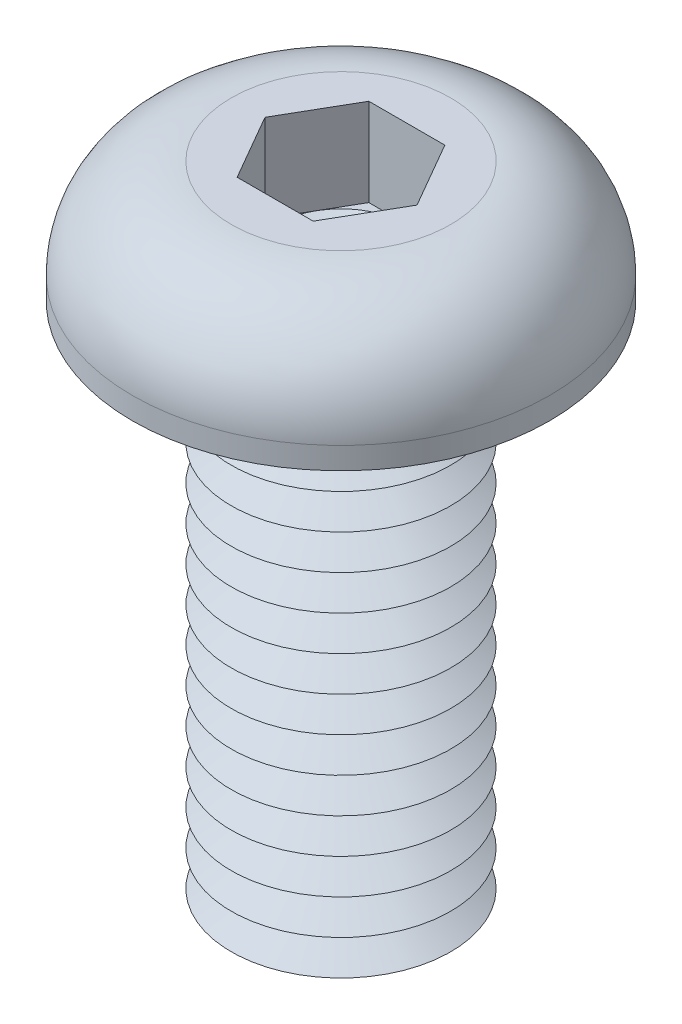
ISO-10303-21;
HEADER;
FILE_DESCRIPTION(('STEP AP214'),'2;1');
FILE_NAME('part.step','',(''),(''),'','','');
FILE_SCHEMA(('AUTOMOTIVE_DESIGN { 1 0 10303 214 1 1 1 1 }'));
ENDSEC;
DATA;
#1=APPLICATION_CONTEXT('core data for automotive mechanical design processes');
#2=APPLICATION_PROTOCOL_DEFINITION('international standard','automotive_design',2000,#1);
#3=PRODUCT_CONTEXT('',#1,'mechanical');
#4=PRODUCT('Part','Part','',(#3));
#5=PRODUCT_RELATED_PRODUCT_CATEGORY('part','',(#4));
#6=PRODUCT_DEFINITION_FORMATION('','',#4);
#7=PRODUCT_DEFINITION_CONTEXT('part definition',#1,'design');
#8=PRODUCT_DEFINITION('design','',#6,#7);
#9=PRODUCT_DEFINITION_SHAPE('','',#8);
#10=(LENGTH_UNIT() NAMED_UNIT(*) SI_UNIT(.MILLI.,.METRE.));
#11=(NAMED_UNIT(*) PLANE_ANGLE_UNIT() SI_UNIT($,.RADIAN.));
#12=(NAMED_UNIT(*) SI_UNIT($,.STERADIAN.) SOLID_ANGLE_UNIT());
#13=UNCERTAINTY_MEASURE_WITH_UNIT(LENGTH_MEASURE(1.E-05),#10,'distance_accuracy_value','');
#14=(GEOMETRIC_REPRESENTATION_CONTEXT(3) GLOBAL_UNCERTAINTY_ASSIGNED_CONTEXT((#13)) GLOBAL_UNIT_ASSIGNED_CONTEXT((#10,
#11,#12)) REPRESENTATION_CONTEXT('',''));
#15=CARTESIAN_POINT('',(0.,0.,0.));
#16=DIRECTION('',(0.,0.,1.));
#17=DIRECTION('',(1.,0.,0.));
#18=AXIS2_PLACEMENT_3D('',#15,#16,#17);
#19=CARTESIAN_POINT('',(0.,0.,0.));
#20=DIRECTION('',(0.,-1.,0.));
#21=DIRECTION('',(0.,0.,-1.));
#22=AXIS2_PLACEMENT_3D('',#19,#20,#21);
#23=TOROIDAL_SURFACE('',#22,2.9,0.4);
#24=CARTESIAN_POINT('',(0.,0.,-3.3));
#25=VERTEX_POINT('',#24);
#26=VERTEX_LOOP('',#25);
#27=FACE_BOUND('',#26,.T.);
#28=ADVANCED_FACE('P0_F12',(#27),#23,.T.);
#29=CLOSED_SHELL('',(#28));
#30=MANIFOLD_SOLID_BREP('P0_B1',#29);
#31=CARTESIAN_POINT('',(0.866025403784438,0.75,-1.5));
#32=DIRECTION('',(0.,1.,0.));
#33=DIRECTION('',(0.,0.,1.));
#34=AXIS2_PLACEMENT_3D('',#31,#32,#33);
#35=PLANE('',#34);
#36=CARTESIAN_POINT('',(0.,0.75,0.));
#37=DIRECTION('',(0.,1.,0.));
#38=DIRECTION('',(0.,0.,1.));
#39=AXIS2_PLACEMENT_3D('',#36,#37,#38);
#40=CIRCLE('',#39,1.5);
#41=CARTESIAN_POINT('',(0.,0.75,1.5));
#42=VERTEX_POINT('',#41);
#43=CARTESIAN_POINT('',(1.29903810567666,0.75,0.75));
#44=VERTEX_POINT('',#43);
#45=EDGE_CURVE('P1_E26',#42,#44,#40,.T.);
#46=ORIENTED_EDGE('',*,*,#45,.F.);
#47=DIRECTION('',(1.,0.,0.));
#48=VECTOR('',#47,1.);
#49=CARTESIAN_POINT('',(-0.866025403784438,0.75,1.5));
#50=LINE('',#49,#48);
#51=CARTESIAN_POINT('',(0.866025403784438,0.75,1.5));
#52=VERTEX_POINT('',#51);
#53=EDGE_CURVE('P1_E117',#42,#52,#50,.T.);
#54=ORIENTED_EDGE('',*,*,#53,.T.);
#55=DIRECTION('',(0.5,0.,-0.866025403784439));
#56=VECTOR('',#55,1.);
#57=CARTESIAN_POINT('',(0.866025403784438,0.75,1.5));
#58=LINE('',#57,#56);
#59=EDGE_CURVE('P1_E113',#52,#44,#58,.T.);
#60=ORIENTED_EDGE('',*,*,#59,.T.);
#61=EDGE_LOOP('',(#46,#54,#60));
#62=FACE_BOUND('',#61,.T.);
#63=ADVANCED_FACE('P1_F15',(#62),#35,.T.);
#64=CARTESIAN_POINT('',(1.29903810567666,0.75,-0.750000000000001));
#65=VERTEX_POINT('',#64);
#66=EDGE_CURVE('P1_E10',#44,#65,#40,.T.);
#67=ORIENTED_EDGE('',*,*,#66,.F.);
#68=CARTESIAN_POINT('',(1.73205080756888,0.75,0.));
#69=VERTEX_POINT('',#68);
#70=EDGE_CURVE('P1_E105',#44,#69,#58,.T.);
#71=ORIENTED_EDGE('',*,*,#70,.T.);
#72=DIRECTION('',(-0.5,0.,-0.866025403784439));
#73=VECTOR('',#72,1.);
#74=CARTESIAN_POINT('',(1.73205080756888,0.75,0.));
#75=LINE('',#74,#73);
#76=EDGE_CURVE('P1_E108',#69,#65,#75,.T.);
#77=ORIENTED_EDGE('',*,*,#76,.T.);
#78=EDGE_LOOP('',(#67,#71,#77));
#79=FACE_BOUND('',#78,.T.);
#80=ADVANCED_FACE('P1_F104',(#79),#35,.T.);
#81=CARTESIAN_POINT('',(0.,0.75,-1.5));
#82=VERTEX_POINT('',#81);
#83=EDGE_CURVE('P1_E24',#65,#82,#40,.T.);
#84=ORIENTED_EDGE('',*,*,#83,.F.);
#85=CARTESIAN_POINT('',(0.866025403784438,0.75,-1.5));
#86=VERTEX_POINT('',#85);
#87=EDGE_CURVE('P1_E140',#65,#86,#75,.T.);
#88=ORIENTED_EDGE('',*,*,#87,.T.);
#89=DIRECTION('',(-1.,0.,0.));
#90=VECTOR('',#89,1.);
#91=CARTESIAN_POINT('',(0.866025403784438,0.75,-1.5));
#92=LINE('',#91,#90);
#93=EDGE_CURVE('P1_E249',#86,#82,#92,.T.);
#94=ORIENTED_EDGE('',*,*,#93,.T.);
#95=EDGE_LOOP('',(#84,#88,#94));
#96=FACE_BOUND('',#95,.T.);
#97=ADVANCED_FACE('P1_F286',(#96),#35,.T.);
#98=CARTESIAN_POINT('',(-1.29903810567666,0.75,-0.75));
#99=VERTEX_POINT('',#98);
#100=EDGE_CURVE('P1_E245',#82,#99,#40,.T.);
#101=ORIENTED_EDGE('',*,*,#100,.F.);
#102=CARTESIAN_POINT('',(-0.866025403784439,0.75,-1.5));
#103=VERTEX_POINT('',#102);
#104=EDGE_CURVE('P1_E248',#82,#103,#92,.T.);
#105=ORIENTED_EDGE('',*,*,#104,.T.);
#106=DIRECTION('',(-0.5,0.,0.866025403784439));
#107=VECTOR('',#106,1.);
#108=CARTESIAN_POINT('',(-0.866025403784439,0.75,-1.5));
#109=LINE('',#108,#107);
#110=EDGE_CURVE('P1_E253',#103,#99,#109,.T.);
#111=ORIENTED_EDGE('',*,*,#110,.T.);
#112=EDGE_LOOP('',(#101,#105,#111));
#113=FACE_BOUND('',#112,.T.);
#114=ADVANCED_FACE('P1_F294',(#113),#35,.T.);
#115=CARTESIAN_POINT('',(-1.29903810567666,0.75,0.75));
#116=VERTEX_POINT('',#115);
#117=EDGE_CURVE('P1_E33',#99,#116,#40,.T.);
#118=ORIENTED_EDGE('',*,*,#117,.F.);
#119=CARTESIAN_POINT('',(-1.73205080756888,0.75,0.));
#120=VERTEX_POINT('',#119);
#121=EDGE_CURVE('P1_E252',#99,#120,#109,.T.);
#122=ORIENTED_EDGE('',*,*,#121,.T.);
#123=DIRECTION('',(0.5,0.,0.866025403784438));
#124=VECTOR('',#123,1.);
#125=CARTESIAN_POINT('',(-1.73205080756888,0.75,0.));
#126=LINE('',#125,#124);
#127=EDGE_CURVE('P1_E256',#120,#116,#126,.T.);
#128=ORIENTED_EDGE('',*,*,#127,.T.);
#129=EDGE_LOOP('',(#118,#122,#128));
#130=FACE_BOUND('',#129,.T.);
#131=ADVANCED_FACE('P1_F290',(#130),#35,.T.);
#132=CARTESIAN_POINT('',(0.,-11.2,0.));
#133=DIRECTION('',(0.,1.,0.));
#134=DIRECTION('',(0.,0.,1.));
#135=AXIS2_PLACEMENT_3D('',#132,#133,#134);
#136=CONICAL_SURFACE('',#135,1.80717967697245,1.0471975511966);
#137=CARTESIAN_POINT('',(0.,-10.8,0.));
#138=DIRECTION('',(0.,-1.,0.));
#139=DIRECTION('',(0.,0.,-1.));
#140=AXIS2_PLACEMENT_3D('',#137,#138,#139);
#141=CIRCLE('',#140,2.5);
#142=CARTESIAN_POINT('',(0.,-10.8,-2.5));
#143=VERTEX_POINT('',#142);
#144=EDGE_CURVE('P1_E233',#143,#143,#141,.T.);
#145=ORIENTED_EDGE('',*,*,#144,.T.);
#146=EDGE_LOOP('',(#145));
#147=FACE_BOUND('',#146,.T.);
#148=CARTESIAN_POINT('',(0.,-11.2,0.));
#149=DIRECTION('',(0.,-1.,0.));
#150=DIRECTION('',(0.,0.,-1.));
#151=AXIS2_PLACEMENT_3D('',#148,#149,#150);
#152=CIRCLE('',#151,1.80717967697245);
#153=CARTESIAN_POINT('',(0.,-11.2,-1.80717967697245));
#154=VERTEX_POINT('',#153);
#155=EDGE_CURVE('P1_E236',#154,#154,#152,.T.);
#156=ORIENTED_EDGE('',*,*,#155,.F.);
#157=EDGE_LOOP('',(#156));
#158=FACE_BOUND('',#157,.T.);
#159=ADVANCED_FACE('P1_F302',(#147,#158),#136,.T.);
#160=CARTESIAN_POINT('',(0.,-11.6,0.));
#161=DIRECTION('',(0.,-1.,0.));
#162=DIRECTION('',(0.,0.,-1.));
#163=AXIS2_PLACEMENT_3D('',#160,#161,#162);
#164=CONICAL_SURFACE('',#163,2.5,1.0471975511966);
#165=ORIENTED_EDGE('',*,*,#155,.T.);
#166=EDGE_LOOP('',(#165));
#167=FACE_BOUND('',#166,.T.);
#168=CARTESIAN_POINT('',(0.,-11.6,0.));
#169=DIRECTION('',(0.,-1.,0.));
#170=DIRECTION('',(0.,0.,-1.));
#171=AXIS2_PLACEMENT_3D('',#168,#169,#170);
#172=CIRCLE('',#171,2.5);
#173=CARTESIAN_POINT('',(0.,-11.6,-2.5));
#174=VERTEX_POINT('',#173);
#175=EDGE_CURVE('P1_E239',#174,#174,#172,.T.);
#176=ORIENTED_EDGE('',*,*,#175,.F.);
#177=EDGE_LOOP('',(#176));
#178=FACE_BOUND('',#177,.T.);
#179=ADVANCED_FACE('P1_F436',(#167,#178),#164,.T.);
#180=CARTESIAN_POINT('',(0.,-12.,0.));
#181=DIRECTION('',(0.,1.,0.));
#182=DIRECTION('',(0.,0.,1.));
#183=AXIS2_PLACEMENT_3D('',#180,#181,#182);
#184=PLANE('',#183);
#185=CARTESIAN_POINT('',(0.,-12.,0.));
#186=DIRECTION('',(0.,-1.,0.));
#187=DIRECTION('',(0.,0.,-1.));
#188=AXIS2_PLACEMENT_3D('',#185,#186,#187);
#189=CIRCLE('',#188,1.80717967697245);
#190=CARTESIAN_POINT('',(0.,-12.,-1.80717967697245));
#191=VERTEX_POINT('',#190);
#192=EDGE_CURVE('P1_E241',#191,#191,#189,.T.);
#193=ORIENTED_EDGE('',*,*,#192,.T.);
#194=EDGE_LOOP('',(#193));
#195=FACE_BOUND('',#194,.T.);
#196=ADVANCED_FACE('P1_F439',(#195),#184,.F.);
#197=CARTESIAN_POINT('',(0.,-12.,0.));
#198=DIRECTION('',(0.,1.,0.));
#199=DIRECTION('',(0.,0.,1.));
#200=AXIS2_PLACEMENT_3D('',#197,#198,#199);
#201=CONICAL_SURFACE('',#200,1.80717967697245,1.0471975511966);
#202=ORIENTED_EDGE('',*,*,#175,.T.);
#203=EDGE_LOOP('',(#202));
#204=FACE_BOUND('',#203,.T.);
#205=ORIENTED_EDGE('',*,*,#192,.F.);
#206=EDGE_LOOP('',(#205));
#207=FACE_BOUND('',#206,.T.);
#208=ADVANCED_FACE('P1_F434',(#204,#207),#201,.T.);
#209=CARTESIAN_POINT('',(0.,-10.4,0.));
#210=DIRECTION('',(0.,1.,0.));
#211=DIRECTION('',(0.,0.,1.));
#212=AXIS2_PLACEMENT_3D('',#209,#210,#211);
#213=CONICAL_SURFACE('',#212,1.80717967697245,1.0471975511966);
#214=CARTESIAN_POINT('',(0.,-10.,0.));
#215=DIRECTION('',(0.,-1.,0.));
#216=DIRECTION('',(0.,0.,-1.));
#217=AXIS2_PLACEMENT_3D('',#214,#215,#216);
#218=CIRCLE('',#217,2.5);
#219=CARTESIAN_POINT('',(0.,-10.,-2.5));
#220=VERTEX_POINT('',#219);
#221=EDGE_CURVE('P1_E227',#220,#220,#218,.T.);
#222=ORIENTED_EDGE('',*,*,#221,.T.);
#223=EDGE_LOOP('',(#222));
#224=FACE_BOUND('',#223,.T.);
#225=CARTESIAN_POINT('',(0.,-10.4,0.));
#226=DIRECTION('',(0.,-1.,0.));
#227=DIRECTION('',(0.,0.,-1.));
#228=AXIS2_PLACEMENT_3D('',#225,#226,#227);
#229=CIRCLE('',#228,1.80717967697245);
#230=CARTESIAN_POINT('',(0.,-10.4,-1.80717967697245));
#231=VERTEX_POINT('',#230);
#232=EDGE_CURVE('P1_E230',#231,#231,#229,.T.);
#233=ORIENTED_EDGE('',*,*,#232,.F.);
#234=EDGE_LOOP('',(#233));
#235=FACE_BOUND('',#234,.T.);
#236=ADVANCED_FACE('P1_F430',(#224,#235),#213,.T.);
#237=CARTESIAN_POINT('',(0.,-10.8,0.));
#238=DIRECTION('',(0.,-1.,0.));
#239=DIRECTION('',(0.,0.,-1.));
#240=AXIS2_PLACEMENT_3D('',#237,#238,#239);
#241=CONICAL_SURFACE('',#240,2.5,1.0471975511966);
#242=ORIENTED_EDGE('',*,*,#232,.T.);
#243=EDGE_LOOP('',(#242));
#244=FACE_BOUND('',#243,.T.);
#245=ORIENTED_EDGE('',*,*,#144,.F.);
#246=EDGE_LOOP('',(#245));
#247=FACE_BOUND('',#246,.T.);
#248=ADVANCED_FACE('P1_F426',(#244,#247),#241,.T.);
#249=CARTESIAN_POINT('',(0.,-9.6,0.));
#250=DIRECTION('',(0.,1.,0.));
#251=DIRECTION('',(0.,0.,1.));
#252=AXIS2_PLACEMENT_3D('',#249,#250,#251);
#253=CONICAL_SURFACE('',#252,1.80717967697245,1.0471975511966);
#254=CARTESIAN_POINT('',(0.,-9.2,0.));
#255=DIRECTION('',(0.,-1.,0.));
#256=DIRECTION('',(0.,0.,-1.));
#257=AXIS2_PLACEMENT_3D('',#254,#255,#256);
#258=CIRCLE('',#257,2.5);
#259=CARTESIAN_POINT('',(0.,-9.2,-2.5));
#260=VERTEX_POINT('',#259);
#261=EDGE_CURVE('P1_E221',#260,#260,#258,.T.);
#262=ORIENTED_EDGE('',*,*,#261,.T.);
#263=EDGE_LOOP('',(#262));
#264=FACE_BOUND('',#263,.T.);
#265=CARTESIAN_POINT('',(0.,-9.6,0.));
#266=DIRECTION('',(0.,-1.,0.));
#267=DIRECTION('',(0.,0.,-1.));
#268=AXIS2_PLACEMENT_3D('',#265,#266,#267);
#269=CIRCLE('',#268,1.80717967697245);
#270=CARTESIAN_POINT('',(0.,-9.6,-1.80717967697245));
#271=VERTEX_POINT('',#270);
#272=EDGE_CURVE('P1_E224',#271,#271,#269,.T.);
#273=ORIENTED_EDGE('',*,*,#272,.F.);
#274=EDGE_LOOP('',(#273));
#275=FACE_BOUND('',#274,.T.);
#276=ADVANCED_FACE('P1_F422',(#264,#275),#253,.T.);
#277=CARTESIAN_POINT('',(0.,-10.,0.));
#278=DIRECTION('',(0.,-1.,0.));
#279=DIRECTION('',(0.,0.,-1.));
#280=AXIS2_PLACEMENT_3D('',#277,#278,#279);
#281=CONICAL_SURFACE('',#280,2.5,1.0471975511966);
#282=ORIENTED_EDGE('',*,*,#272,.T.);
#283=EDGE_LOOP('',(#282));
#284=FACE_BOUND('',#283,.T.);
#285=ORIENTED_EDGE('',*,*,#221,.F.);
#286=EDGE_LOOP('',(#285));
#287=FACE_BOUND('',#286,.T.);
#288=ADVANCED_FACE('P1_F418',(#284,#287),#281,.T.);
#289=CARTESIAN_POINT('',(0.,-8.8,0.));
#290=DIRECTION('',(0.,1.,0.));
#291=DIRECTION('',(0.,0.,1.));
#292=AXIS2_PLACEMENT_3D('',#289,#290,#291);
#293=CONICAL_SURFACE('',#292,1.80717967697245,1.0471975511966);
#294=CARTESIAN_POINT('',(0.,-8.4,0.));
#295=DIRECTION('',(0.,-1.,0.));
#296=DIRECTION('',(0.,0.,-1.));
#297=AXIS2_PLACEMENT_3D('',#294,#295,#296);
#298=CIRCLE('',#297,2.5);
#299=CARTESIAN_POINT('',(0.,-8.4,-2.5));
#300=VERTEX_POINT('',#299);
#301=EDGE_CURVE('P1_E215',#300,#300,#298,.T.);
#302=ORIENTED_EDGE('',*,*,#301,.T.);
#303=EDGE_LOOP('',(#302));
#304=FACE_BOUND('',#303,.T.);
#305=CARTESIAN_POINT('',(0.,-8.8,0.));
#306=DIRECTION('',(0.,-1.,0.));
#307=DIRECTION('',(0.,0.,-1.));
#308=AXIS2_PLACEMENT_3D('',#305,#306,#307);
#309=CIRCLE('',#308,1.80717967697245);
#310=CARTESIAN_POINT('',(0.,-8.8,-1.80717967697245));
#311=VERTEX_POINT('',#310);
#312=EDGE_CURVE('P1_E218',#311,#311,#309,.T.);
#313=ORIENTED_EDGE('',*,*,#312,.F.);
#314=EDGE_LOOP('',(#313));
#315=FACE_BOUND('',#314,.T.);
#316=ADVANCED_FACE('P1_F414',(#304,#315),#293,.T.);
#317=CARTESIAN_POINT('',(0.,-9.2,0.));
#318=DIRECTION('',(0.,-1.,0.));
#319=DIRECTION('',(0.,0.,-1.));
#320=AXIS2_PLACEMENT_3D('',#317,#318,#319);
#321=CONICAL_SURFACE('',#320,2.5,1.0471975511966);
#322=ORIENTED_EDGE('',*,*,#312,.T.);
#323=EDGE_LOOP('',(#322));
#324=FACE_BOUND('',#323,.T.);
#325=ORIENTED_EDGE('',*,*,#261,.F.);
#326=EDGE_LOOP('',(#325));
#327=FACE_BOUND('',#326,.T.);
#328=ADVANCED_FACE('P1_F410',(#324,#327),#321,.T.);
#329=CARTESIAN_POINT('',(0.,-8.,0.));
#330=DIRECTION('',(0.,1.,0.));
#331=DIRECTION('',(0.,0.,1.));
#332=AXIS2_PLACEMENT_3D('',#329,#330,#331);
#333=CONICAL_SURFACE('',#332,1.80717967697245,1.0471975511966);
#334=CARTESIAN_POINT('',(0.,-7.6,0.));
#335=DIRECTION('',(0.,-1.,0.));
#336=DIRECTION('',(0.,0.,-1.));
#337=AXIS2_PLACEMENT_3D('',#334,#335,#336);
#338=CIRCLE('',#337,2.5);
#339=CARTESIAN_POINT('',(0.,-7.6,-2.5));
#340=VERTEX_POINT('',#339);
#341=EDGE_CURVE('P1_E209',#340,#340,#338,.T.);
#342=ORIENTED_EDGE('',*,*,#341,.T.);
#343=EDGE_LOOP('',(#342));
#344=FACE_BOUND('',#343,.T.);
#345=CARTESIAN_POINT('',(0.,-8.,0.));
#346=DIRECTION('',(0.,-1.,0.));
#347=DIRECTION('',(0.,0.,-1.));
#348=AXIS2_PLACEMENT_3D('',#345,#346,#347);
#349=CIRCLE('',#348,1.80717967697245);
#350=CARTESIAN_POINT('',(0.,-8.,-1.80717967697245));
#351=VERTEX_POINT('',#350);
#352=EDGE_CURVE('P1_E212',#351,#351,#349,.T.);
#353=ORIENTED_EDGE('',*,*,#352,.F.);
#354=EDGE_LOOP('',(#353));
#355=FACE_BOUND('',#354,.T.);
#356=ADVANCED_FACE('P1_F406',(#344,#355),#333,.T.);
#357=CARTESIAN_POINT('',(0.,-8.4,0.));
#358=DIRECTION('',(0.,-1.,0.));
#359=DIRECTION('',(0.,0.,-1.));
#360=AXIS2_PLACEMENT_3D('',#357,#358,#359);
#361=CONICAL_SURFACE('',#360,2.5,1.0471975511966);
#362=ORIENTED_EDGE('',*,*,#352,.T.);
#363=EDGE_LOOP('',(#362));
#364=FACE_BOUND('',#363,.T.);
#365=ORIENTED_EDGE('',*,*,#301,.F.);
#366=EDGE_LOOP('',(#365));
#367=FACE_BOUND('',#366,.T.);
#368=ADVANCED_FACE('P1_F402',(#364,#367),#361,.T.);
#369=CARTESIAN_POINT('',(0.,-7.2,0.));
#370=DIRECTION('',(0.,1.,0.));
#371=DIRECTION('',(0.,0.,1.));
#372=AXIS2_PLACEMENT_3D('',#369,#370,#371);
#373=CONICAL_SURFACE('',#372,1.80717967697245,1.0471975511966);
#374=CARTESIAN_POINT('',(0.,-6.8,0.));
#375=DIRECTION('',(0.,-1.,0.));
#376=DIRECTION('',(0.,0.,-1.));
#377=AXIS2_PLACEMENT_3D('',#374,#375,#376);
#378=CIRCLE('',#377,2.5);
#379=CARTESIAN_POINT('',(0.,-6.8,-2.5));
#380=VERTEX_POINT('',#379);
#381=EDGE_CURVE('P1_E203',#380,#380,#378,.T.);
#382=ORIENTED_EDGE('',*,*,#381,.T.);
#383=EDGE_LOOP('',(#382));
#384=FACE_BOUND('',#383,.T.);
#385=CARTESIAN_POINT('',(0.,-7.2,0.));
#386=DIRECTION('',(0.,-1.,0.));
#387=DIRECTION('',(0.,0.,-1.));
#388=AXIS2_PLACEMENT_3D('',#385,#386,#387);
#389=CIRCLE('',#388,1.80717967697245);
#390=CARTESIAN_POINT('',(0.,-7.2,-1.80717967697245));
#391=VERTEX_POINT('',#390);
#392=EDGE_CURVE('P1_E206',#391,#391,#389,.T.);
#393=ORIENTED_EDGE('',*,*,#392,.F.);
#394=EDGE_LOOP('',(#393));
#395=FACE_BOUND('',#394,.T.);
#396=ADVANCED_FACE('P1_F398',(#384,#395),#373,.T.);
#397=CARTESIAN_POINT('',(0.,-7.6,0.));
#398=DIRECTION('',(0.,-1.,0.));
#399=DIRECTION('',(0.,0.,-1.));
#400=AXIS2_PLACEMENT_3D('',#397,#398,#399);
#401=CONICAL_SURFACE('',#400,2.5,1.0471975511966);
#402=ORIENTED_EDGE('',*,*,#392,.T.);
#403=EDGE_LOOP('',(#402));
#404=FACE_BOUND('',#403,.T.);
#405=ORIENTED_EDGE('',*,*,#341,.F.);
#406=EDGE_LOOP('',(#405));
#407=FACE_BOUND('',#406,.T.);
#408=ADVANCED_FACE('P1_F394',(#404,#407),#401,.T.);
#409=CARTESIAN_POINT('',(0.,-6.4,0.));
#410=DIRECTION('',(0.,1.,0.));
#411=DIRECTION('',(0.,0.,1.));
#412=AXIS2_PLACEMENT_3D('',#409,#410,#411);
#413=CONICAL_SURFACE('',#412,1.80717967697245,1.0471975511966);
#414=CARTESIAN_POINT('',(0.,-6.,0.));
#415=DIRECTION('',(0.,-1.,0.));
#416=DIRECTION('',(0.,0.,-1.));
#417=AXIS2_PLACEMENT_3D('',#414,#415,#416);
#418=CIRCLE('',#417,2.5);
#419=CARTESIAN_POINT('',(0.,-6.,-2.5));
#420=VERTEX_POINT('',#419);
#421=EDGE_CURVE('P1_E197',#420,#420,#418,.T.);
#422=ORIENTED_EDGE('',*,*,#421,.T.);
#423=EDGE_LOOP('',(#422));
#424=FACE_BOUND('',#423,.T.);
#425=CARTESIAN_POINT('',(0.,-6.4,0.));
#426=DIRECTION('',(0.,-1.,0.));
#427=DIRECTION('',(0.,0.,-1.));
#428=AXIS2_PLACEMENT_3D('',#425,#426,#427);
#429=CIRCLE('',#428,1.80717967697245);
#430=CARTESIAN_POINT('',(0.,-6.4,-1.80717967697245));
#431=VERTEX_POINT('',#430);
#432=EDGE_CURVE('P1_E200',#431,#431,#429,.T.);
#433=ORIENTED_EDGE('',*,*,#432,.F.);
#434=EDGE_LOOP('',(#433));
#435=FACE_BOUND('',#434,.T.);
#436=ADVANCED_FACE('P1_F390',(#424,#435),#413,.T.);
#437=CARTESIAN_POINT('',(0.,-6.8,0.));
#438=DIRECTION('',(0.,-1.,0.));
#439=DIRECTION('',(0.,0.,-1.));
#440=AXIS2_PLACEMENT_3D('',#437,#438,#439);
#441=CONICAL_SURFACE('',#440,2.5,1.0471975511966);
#442=ORIENTED_EDGE('',*,*,#432,.T.);
#443=EDGE_LOOP('',(#442));
#444=FACE_BOUND('',#443,.T.);
#445=ORIENTED_EDGE('',*,*,#381,.F.);
#446=EDGE_LOOP('',(#445));
#447=FACE_BOUND('',#446,.T.);
#448=ADVANCED_FACE('P1_F386',(#444,#447),#441,.T.);
#449=CARTESIAN_POINT('',(0.,-5.6,0.));
#450=DIRECTION('',(0.,1.,0.));
#451=DIRECTION('',(0.,0.,1.));
#452=AXIS2_PLACEMENT_3D('',#449,#450,#451);
#453=CONICAL_SURFACE('',#452,1.80717967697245,1.0471975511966);
#454=CARTESIAN_POINT('',(0.,-5.2,0.));
#455=DIRECTION('',(0.,-1.,0.));
#456=DIRECTION('',(0.,0.,-1.));
#457=AXIS2_PLACEMENT_3D('',#454,#455,#456);
#458=CIRCLE('',#457,2.5);
#459=CARTESIAN_POINT('',(0.,-5.2,-2.5));
#460=VERTEX_POINT('',#459);
#461=EDGE_CURVE('P1_E191',#460,#460,#458,.T.);
#462=ORIENTED_EDGE('',*,*,#461,.T.);
#463=EDGE_LOOP('',(#462));
#464=FACE_BOUND('',#463,.T.);
#465=CARTESIAN_POINT('',(0.,-5.6,0.));
#466=DIRECTION('',(0.,-1.,0.));
#467=DIRECTION('',(0.,0.,-1.));
#468=AXIS2_PLACEMENT_3D('',#465,#466,#467);
#469=CIRCLE('',#468,1.80717967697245);
#470=CARTESIAN_POINT('',(0.,-5.6,-1.80717967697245));
#471=VERTEX_POINT('',#470);
#472=EDGE_CURVE('P1_E194',#471,#471,#469,.T.);
#473=ORIENTED_EDGE('',*,*,#472,.F.);
#474=EDGE_LOOP('',(#473));
#475=FACE_BOUND('',#474,.T.);
#476=ADVANCED_FACE('P1_F382',(#464,#475),#453,.T.);
#477=CARTESIAN_POINT('',(0.,-6.,0.));
#478=DIRECTION('',(0.,-1.,0.));
#479=DIRECTION('',(0.,0.,-1.));
#480=AXIS2_PLACEMENT_3D('',#477,#478,#479);
#481=CONICAL_SURFACE('',#480,2.5,1.0471975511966);
#482=ORIENTED_EDGE('',*,*,#472,.T.);
#483=EDGE_LOOP('',(#482));
#484=FACE_BOUND('',#483,.T.);
#485=ORIENTED_EDGE('',*,*,#421,.F.);
#486=EDGE_LOOP('',(#485));
#487=FACE_BOUND('',#486,.T.);
#488=ADVANCED_FACE('P1_F378',(#484,#487),#481,.T.);
#489=CARTESIAN_POINT('',(0.,-4.8,0.));
#490=DIRECTION('',(0.,1.,0.));
#491=DIRECTION('',(0.,0.,1.));
#492=AXIS2_PLACEMENT_3D('',#489,#490,#491);
#493=CONICAL_SURFACE('',#492,1.80717967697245,1.0471975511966);
#494=CARTESIAN_POINT('',(0.,-4.4,0.));
#495=DIRECTION('',(0.,-1.,0.));
#496=DIRECTION('',(0.,0.,-1.));
#497=AXIS2_PLACEMENT_3D('',#494,#495,#496);
#498=CIRCLE('',#497,2.5);
#499=CARTESIAN_POINT('',(0.,-4.4,-2.5));
#500=VERTEX_POINT('',#499);
#501=EDGE_CURVE('P1_E185',#500,#500,#498,.T.);
#502=ORIENTED_EDGE('',*,*,#501,.T.);
#503=EDGE_LOOP('',(#502));
#504=FACE_BOUND('',#503,.T.);
#505=CARTESIAN_POINT('',(0.,-4.8,0.));
#506=DIRECTION('',(0.,-1.,0.));
#507=DIRECTION('',(0.,0.,-1.));
#508=AXIS2_PLACEMENT_3D('',#505,#506,#507);
#509=CIRCLE('',#508,1.80717967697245);
#510=CARTESIAN_POINT('',(0.,-4.8,-1.80717967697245));
#511=VERTEX_POINT('',#510);
#512=EDGE_CURVE('P1_E188',#511,#511,#509,.T.);
#513=ORIENTED_EDGE('',*,*,#512,.F.);
#514=EDGE_LOOP('',(#513));
#515=FACE_BOUND('',#514,.T.);
#516=ADVANCED_FACE('P1_F374',(#504,#515),#493,.T.);
#517=CARTESIAN_POINT('',(0.,-5.2,0.));
#518=DIRECTION('',(0.,-1.,0.));
#519=DIRECTION('',(0.,0.,-1.));
#520=AXIS2_PLACEMENT_3D('',#517,#518,#519);
#521=CONICAL_SURFACE('',#520,2.5,1.0471975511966);
#522=ORIENTED_EDGE('',*,*,#512,.T.);
#523=EDGE_LOOP('',(#522));
#524=FACE_BOUND('',#523,.T.);
#525=ORIENTED_EDGE('',*,*,#461,.F.);
#526=EDGE_LOOP('',(#525));
#527=FACE_BOUND('',#526,.T.);
#528=ADVANCED_FACE('P1_F370',(#524,#527),#521,.T.);
#529=CARTESIAN_POINT('',(0.,-4.,0.));
#530=DIRECTION('',(0.,1.,0.));
#531=DIRECTION('',(0.,0.,1.));
#532=AXIS2_PLACEMENT_3D('',#529,#530,#531);
#533=CONICAL_SURFACE('',#532,1.80717967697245,1.0471975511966);
#534=CARTESIAN_POINT('',(0.,-3.6,0.));
#535=DIRECTION('',(0.,-1.,0.));
#536=DIRECTION('',(0.,0.,-1.));
#537=AXIS2_PLACEMENT_3D('',#534,#535,#536);
#538=CIRCLE('',#537,2.5);
#539=CARTESIAN_POINT('',(0.,-3.6,-2.5));
#540=VERTEX_POINT('',#539);
#541=EDGE_CURVE('P1_E179',#540,#540,#538,.T.);
#542=ORIENTED_EDGE('',*,*,#541,.T.);
#543=EDGE_LOOP('',(#542));
#544=FACE_BOUND('',#543,.T.);
#545=CARTESIAN_POINT('',(0.,-4.,0.));
#546=DIRECTION('',(0.,-1.,0.));
#547=DIRECTION('',(0.,0.,-1.));
#548=AXIS2_PLACEMENT_3D('',#545,#546,#547);
#549=CIRCLE('',#548,1.80717967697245);
#550=CARTESIAN_POINT('',(0.,-4.,-1.80717967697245));
#551=VERTEX_POINT('',#550);
#552=EDGE_CURVE('P1_E182',#551,#551,#549,.T.);
#553=ORIENTED_EDGE('',*,*,#552,.F.);
#554=EDGE_LOOP('',(#553));
#555=FACE_BOUND('',#554,.T.);
#556=ADVANCED_FACE('P1_F366',(#544,#555),#533,.T.);
#557=CARTESIAN_POINT('',(0.,-4.4,0.));
#558=DIRECTION('',(0.,-1.,0.));
#559=DIRECTION('',(0.,0.,-1.));
#560=AXIS2_PLACEMENT_3D('',#557,#558,#559);
#561=CONICAL_SURFACE('',#560,2.5,1.0471975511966);
#562=ORIENTED_EDGE('',*,*,#552,.T.);
#563=EDGE_LOOP('',(#562));
#564=FACE_BOUND('',#563,.T.);
#565=ORIENTED_EDGE('',*,*,#501,.F.);
#566=EDGE_LOOP('',(#565));
#567=FACE_BOUND('',#566,.T.);
#568=ADVANCED_FACE('P1_F362',(#564,#567),#561,.T.);
#569=CARTESIAN_POINT('',(0.,-3.2,0.));
#570=DIRECTION('',(0.,1.,0.));
#571=DIRECTION('',(0.,0.,1.));
#572=AXIS2_PLACEMENT_3D('',#569,#570,#571);
#573=CONICAL_SURFACE('',#572,1.80717967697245,1.0471975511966);
#574=CARTESIAN_POINT('',(0.,-2.8,0.));
#575=DIRECTION('',(0.,-1.,0.));
#576=DIRECTION('',(0.,0.,-1.));
#577=AXIS2_PLACEMENT_3D('',#574,#575,#576);
#578=CIRCLE('',#577,2.5);
#579=CARTESIAN_POINT('',(0.,-2.8,-2.5));
#580=VERTEX_POINT('',#579);
#581=EDGE_CURVE('P1_E173',#580,#580,#578,.T.);
#582=ORIENTED_EDGE('',*,*,#581,.T.);
#583=EDGE_LOOP('',(#582));
#584=FACE_BOUND('',#583,.T.);
#585=CARTESIAN_POINT('',(0.,-3.2,0.));
#586=DIRECTION('',(0.,-1.,0.));
#587=DIRECTION('',(0.,0.,-1.));
#588=AXIS2_PLACEMENT_3D('',#585,#586,#587);
#589=CIRCLE('',#588,1.80717967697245);
#590=CARTESIAN_POINT('',(0.,-3.2,-1.80717967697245));
#591=VERTEX_POINT('',#590);
#592=EDGE_CURVE('P1_E176',#591,#591,#589,.T.);
#593=ORIENTED_EDGE('',*,*,#592,.F.);
#594=EDGE_LOOP('',(#593));
#595=FACE_BOUND('',#594,.T.);
#596=ADVANCED_FACE('P1_F358',(#584,#595),#573,.T.);
#597=CARTESIAN_POINT('',(0.,-3.6,0.));
#598=DIRECTION('',(0.,-1.,0.));
#599=DIRECTION('',(0.,0.,-1.));
#600=AXIS2_PLACEMENT_3D('',#597,#598,#599);
#601=CONICAL_SURFACE('',#600,2.5,1.0471975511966);
#602=ORIENTED_EDGE('',*,*,#592,.T.);
#603=EDGE_LOOP('',(#602));
#604=FACE_BOUND('',#603,.T.);
#605=ORIENTED_EDGE('',*,*,#541,.F.);
#606=EDGE_LOOP('',(#605));
#607=FACE_BOUND('',#606,.T.);
#608=ADVANCED_FACE('P1_F354',(#604,#607),#601,.T.);
#609=CARTESIAN_POINT('',(0.,-2.4,0.));
#610=DIRECTION('',(0.,1.,0.));
#611=DIRECTION('',(0.,0.,1.));
#612=AXIS2_PLACEMENT_3D('',#609,#610,#611);
#613=CONICAL_SURFACE('',#612,1.80717967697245,1.0471975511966);
#614=CARTESIAN_POINT('',(0.,-2.,0.));
#615=DIRECTION('',(0.,-1.,0.));
#616=DIRECTION('',(0.,0.,-1.));
#617=AXIS2_PLACEMENT_3D('',#614,#615,#616);
#618=CIRCLE('',#617,2.5);
#619=CARTESIAN_POINT('',(0.,-2.,-2.5));
#620=VERTEX_POINT('',#619);
#621=EDGE_CURVE('P1_E164',#620,#620,#618,.T.);
#622=ORIENTED_EDGE('',*,*,#621,.T.);
#623=EDGE_LOOP('',(#622));
#624=FACE_BOUND('',#623,.T.);
#625=CARTESIAN_POINT('',(0.,-2.4,0.));
#626=DIRECTION('',(0.,-1.,0.));
#627=DIRECTION('',(0.,0.,-1.));
#628=AXIS2_PLACEMENT_3D('',#625,#626,#627);
#629=CIRCLE('',#628,1.80717967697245);
#630=CARTESIAN_POINT('',(0.,-2.4,-1.80717967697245));
#631=VERTEX_POINT('',#630);
#632=EDGE_CURVE('P1_E170',#631,#631,#629,.T.);
#633=ORIENTED_EDGE('',*,*,#632,.F.);
#634=EDGE_LOOP('',(#633));
#635=FACE_BOUND('',#634,.T.);
#636=ADVANCED_FACE('P1_F350',(#624,#635),#613,.T.);
#637=CARTESIAN_POINT('',(0.,-2.8,0.));
#638=DIRECTION('',(0.,-1.,0.));
#639=DIRECTION('',(0.,0.,-1.));
#640=AXIS2_PLACEMENT_3D('',#637,#638,#639);
#641=CONICAL_SURFACE('',#640,2.5,1.0471975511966);
#642=ORIENTED_EDGE('',*,*,#632,.T.);
#643=EDGE_LOOP('',(#642));
#644=FACE_BOUND('',#643,.T.);
#645=ORIENTED_EDGE('',*,*,#581,.F.);
#646=EDGE_LOOP('',(#645));
#647=FACE_BOUND('',#646,.T.);
#648=ADVANCED_FACE('P1_F346',(#644,#647),#641,.T.);
#649=CARTESIAN_POINT('',(0.,-1.6,0.));
#650=DIRECTION('',(0.,1.,0.));
#651=DIRECTION('',(0.,0.,1.));
#652=AXIS2_PLACEMENT_3D('',#649,#650,#651);
#653=CONICAL_SURFACE('',#652,1.80717967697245,1.0471975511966);
#654=CARTESIAN_POINT('',(0.,-1.2,0.));
#655=DIRECTION('',(0.,-1.,0.));
#656=DIRECTION('',(0.,0.,-1.));
#657=AXIS2_PLACEMENT_3D('',#654,#655,#656);
#658=CIRCLE('',#657,2.5);
#659=CARTESIAN_POINT('',(0.,-1.2,-2.5));
#660=VERTEX_POINT('',#659);
#661=EDGE_CURVE('P1_E167',#660,#660,#658,.T.);
#662=ORIENTED_EDGE('',*,*,#661,.T.);
#663=EDGE_LOOP('',(#662));
#664=FACE_BOUND('',#663,.T.);
#665=CARTESIAN_POINT('',(0.,-1.6,0.));
#666=DIRECTION('',(0.,-1.,0.));
#667=DIRECTION('',(0.,0.,-1.));
#668=AXIS2_PLACEMENT_3D('',#665,#666,#667);
#669=CIRCLE('',#668,1.80717967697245);
#670=CARTESIAN_POINT('',(0.,-1.6,-1.80717967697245));
#671=VERTEX_POINT('',#670);
#672=EDGE_CURVE('P1_E161',#671,#671,#669,.T.);
#673=ORIENTED_EDGE('',*,*,#672,.F.);
#674=EDGE_LOOP('',(#673));
#675=FACE_BOUND('',#674,.T.);
#676=ADVANCED_FACE('P1_F342',(#664,#675),#653,.T.);
#677=CARTESIAN_POINT('',(0.,-2.,0.));
#678=DIRECTION('',(0.,-1.,0.));
#679=DIRECTION('',(0.,0.,-1.));
#680=AXIS2_PLACEMENT_3D('',#677,#678,#679);
#681=CONICAL_SURFACE('',#680,2.5,1.0471975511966);
#682=ORIENTED_EDGE('',*,*,#672,.T.);
#683=EDGE_LOOP('',(#682));
#684=FACE_BOUND('',#683,.T.);
#685=ORIENTED_EDGE('',*,*,#621,.F.);
#686=EDGE_LOOP('',(#685));
#687=FACE_BOUND('',#686,.T.);
#688=ADVANCED_FACE('P1_F339',(#684,#687),#681,.T.);
#689=CARTESIAN_POINT('',(0.,-12.,0.));
#690=DIRECTION('',(0.,1.,0.));
#691=DIRECTION('',(0.,0.,1.));
#692=AXIS2_PLACEMENT_3D('',#689,#690,#691);
#693=CYLINDRICAL_SURFACE('',#692,2.5);
#694=CARTESIAN_POINT('',(0.,0.,0.));
#695=DIRECTION('',(0.,-1.,0.));
#696=DIRECTION('',(1.,0.,0.));
#697=AXIS2_PLACEMENT_3D('',#694,#695,#696);
#698=CIRCLE('',#697,2.5);
#699=CARTESIAN_POINT('',(2.5,0.,0.));
#700=VERTEX_POINT('',#699);
#701=EDGE_CURVE('P1_E142',#700,#700,#698,.F.);
#702=ORIENTED_EDGE('',*,*,#701,.F.);
#703=EDGE_LOOP('',(#702));
#704=FACE_BOUND('',#703,.T.);
#705=ORIENTED_EDGE('',*,*,#661,.F.);
#706=EDGE_LOOP('',(#705));
#707=FACE_BOUND('',#706,.T.);
#708=ADVANCED_FACE('P1_F17',(#704,#707),#693,.T.);
#709=CARTESIAN_POINT('',(0.,0.,0.));
#710=DIRECTION('',(0.,-1.,0.));
#711=DIRECTION('',(0.,0.,-1.));
#712=AXIS2_PLACEMENT_3D('',#709,#710,#711);
#713=TOROIDAL_SURFACE('',#712,2.9,0.4);
#714=ORIENTED_EDGE('',*,*,#701,.T.);
#715=EDGE_LOOP('',(#714));
#716=FACE_BOUND('',#715,.T.);
#717=CARTESIAN_POINT('',(0.,0.,0.));
#718=DIRECTION('',(0.,1.,0.));
#719=DIRECTION('',(-1.,0.,0.));
#720=AXIS2_PLACEMENT_3D('',#717,#718,#719);
#721=CIRCLE('',#720,3.3);
#722=CARTESIAN_POINT('',(-3.3,0.,0.));
#723=VERTEX_POINT('',#722);
#724=EDGE_CURVE('P1_E19',#723,#723,#721,.F.);
#725=ORIENTED_EDGE('',*,*,#724,.T.);
#726=EDGE_LOOP('',(#725));
#727=FACE_BOUND('',#726,.T.);
#728=ADVANCED_FACE('P1_F322',(#716,#727),#713,.F.);
#729=CARTESIAN_POINT('',(2.5,2.75,0.));
#730=DIRECTION('',(0.,-1.,0.));
#731=DIRECTION('',(1.,0.,0.));
#732=AXIS2_PLACEMENT_3D('',#729,#730,#731);
#733=PLANE('',#732);
#734=DIRECTION('',(-1.,0.,0.));
#735=VECTOR('',#734,1.);
#736=CARTESIAN_POINT('',(0.866025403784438,2.75,-1.5));
#737=LINE('',#736,#735);
#738=CARTESIAN_POINT('',(0.866025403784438,2.75,-1.5));
#739=VERTEX_POINT('',#738);
#740=CARTESIAN_POINT('',(-0.866025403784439,2.75,-1.5));
#741=VERTEX_POINT('',#740);
#742=EDGE_CURVE('P1_E126',#739,#741,#737,.T.);
#743=ORIENTED_EDGE('',*,*,#742,.F.);
#744=DIRECTION('',(-0.5,0.,-0.866025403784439));
#745=VECTOR('',#744,1.);
#746=CARTESIAN_POINT('',(1.73205080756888,2.75,0.));
#747=LINE('',#746,#745);
#748=CARTESIAN_POINT('',(1.73205080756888,2.75,0.));
#749=VERTEX_POINT('',#748);
#750=EDGE_CURVE('P1_E41',#749,#739,#747,.T.);
#751=ORIENTED_EDGE('',*,*,#750,.F.);
#752=DIRECTION('',(0.5,0.,-0.866025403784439));
#753=VECTOR('',#752,1.);
#754=CARTESIAN_POINT('',(0.866025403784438,2.75,1.5));
#755=LINE('',#754,#753);
#756=CARTESIAN_POINT('',(0.866025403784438,2.75,1.5));
#757=VERTEX_POINT('',#756);
#758=EDGE_CURVE('P1_E138',#757,#749,#755,.T.);
#759=ORIENTED_EDGE('',*,*,#758,.F.);
#760=DIRECTION('',(1.,0.,0.));
#761=VECTOR('',#760,1.);
#762=CARTESIAN_POINT('',(-0.866025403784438,2.75,1.5));
#763=LINE('',#762,#761);
#764=CARTESIAN_POINT('',(-0.866025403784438,2.75,1.5));
#765=VERTEX_POINT('',#764);
#766=EDGE_CURVE('P1_E135',#765,#757,#763,.T.);
#767=ORIENTED_EDGE('',*,*,#766,.F.);
#768=DIRECTION('',(0.5,0.,0.866025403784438));
#769=VECTOR('',#768,1.);
#770=CARTESIAN_POINT('',(-1.73205080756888,2.75,0.));
#771=LINE('',#770,#769);
#772=CARTESIAN_POINT('',(-1.73205080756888,2.75,0.));
#773=VERTEX_POINT('',#772);
#774=EDGE_CURVE('P1_E132',#773,#765,#771,.T.);
#775=ORIENTED_EDGE('',*,*,#774,.F.);
#776=DIRECTION('',(-0.5,0.,0.866025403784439));
#777=VECTOR('',#776,1.);
#778=CARTESIAN_POINT('',(-0.866025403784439,2.75,-1.5));
#779=LINE('',#778,#777);
#780=EDGE_CURVE('P1_E129',#741,#773,#779,.T.);
#781=ORIENTED_EDGE('',*,*,#780,.F.);
#782=EDGE_LOOP('',(#743,#751,#759,#767,#775,#781));
#783=FACE_BOUND('',#782,.T.);
#784=CARTESIAN_POINT('',(0.,2.75,0.));
#785=DIRECTION('',(0.,1.,0.));
#786=DIRECTION('',(-1.,0.,0.));
#787=AXIS2_PLACEMENT_3D('',#784,#785,#786);
#788=CIRCLE('',#787,2.5);
#789=CARTESIAN_POINT('',(-2.5,2.75,0.));
#790=VERTEX_POINT('',#789);
#791=EDGE_CURVE('P1_E152',#790,#790,#788,.T.);
#792=ORIENTED_EDGE('',*,*,#791,.T.);
#793=EDGE_LOOP('',(#792));
#794=FACE_BOUND('',#793,.T.);
#795=ADVANCED_FACE('P1_F274',(#783,#794),#733,.F.);
#796=CARTESIAN_POINT('',(0.,0.5,0.));
#797=DIRECTION('',(0.,1.,0.));
#798=DIRECTION('',(-1.,0.,0.));
#799=AXIS2_PLACEMENT_3D('',#796,#797,#798);
#800=TOROIDAL_SURFACE('',#799,2.5,2.25);
#801=ORIENTED_EDGE('',*,*,#791,.F.);
#802=EDGE_LOOP('',(#801));
#803=FACE_BOUND('',#802,.T.);
#804=CARTESIAN_POINT('',(0.,0.5,0.));
#805=DIRECTION('',(0.,1.,0.));
#806=DIRECTION('',(-1.,0.,0.));
#807=AXIS2_PLACEMENT_3D('',#804,#805,#806);
#808=CIRCLE('',#807,4.75);
#809=CARTESIAN_POINT('',(-4.75,0.5,0.));
#810=VERTEX_POINT('',#809);
#811=EDGE_CURVE('P1_E155',#810,#810,#808,.T.);
#812=ORIENTED_EDGE('',*,*,#811,.T.);
#813=EDGE_LOOP('',(#812));
#814=FACE_BOUND('',#813,.T.);
#815=ADVANCED_FACE('P1_F328',(#803,#814),#800,.T.);
#816=CARTESIAN_POINT('',(0.,2.75,0.));
#817=DIRECTION('',(0.,1.,0.));
#818=DIRECTION('',(-1.,0.,0.));
#819=AXIS2_PLACEMENT_3D('',#816,#817,#818);
#820=CYLINDRICAL_SURFACE('',#819,4.75);
#821=ORIENTED_EDGE('',*,*,#811,.F.);
#822=EDGE_LOOP('',(#821));
#823=FACE_BOUND('',#822,.T.);
#824=CARTESIAN_POINT('',(0.,0.,0.));
#825=DIRECTION('',(0.,1.,0.));
#826=DIRECTION('',(-1.,0.,0.));
#827=AXIS2_PLACEMENT_3D('',#824,#825,#826);
#828=CIRCLE('',#827,4.75);
#829=CARTESIAN_POINT('',(-4.75,0.,0.));
#830=VERTEX_POINT('',#829);
#831=EDGE_CURVE('P1_E158',#830,#830,#828,.T.);
#832=ORIENTED_EDGE('',*,*,#831,.T.);
#833=EDGE_LOOP('',(#832));
#834=FACE_BOUND('',#833,.T.);
#835=ADVANCED_FACE('P1_F331',(#823,#834),#820,.T.);
#836=CARTESIAN_POINT('',(0.,0.,0.));
#837=DIRECTION('',(0.,1.,0.));
#838=DIRECTION('',(-1.,0.,0.));
#839=AXIS2_PLACEMENT_3D('',#836,#837,#838);
#840=PLANE('',#839);
#841=ORIENTED_EDGE('',*,*,#831,.F.);
#842=EDGE_LOOP('',(#841));
#843=FACE_BOUND('',#842,.T.);
#844=ORIENTED_EDGE('',*,*,#724,.F.);
#845=EDGE_LOOP('',(#844));
#846=FACE_BOUND('',#845,.T.);
#847=ADVANCED_FACE('P1_F321',(#843,#846),#840,.F.);
#848=CARTESIAN_POINT('',(1.73205080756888,0.75,0.));
#849=DIRECTION('',(0.866025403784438,0.,-0.5));
#850=DIRECTION('',(-0.5,0.,-0.866025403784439));
#851=AXIS2_PLACEMENT_3D('',#848,#849,#850);
#852=PLANE('',#851);
#853=ORIENTED_EDGE('',*,*,#750,.T.);
#854=DIRECTION('',(0.,1.,0.));
#855=VECTOR('',#854,1.);
#856=CARTESIAN_POINT('',(0.866025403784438,0.75,-1.5));
#857=LINE('',#856,#855);
#858=EDGE_CURVE('P1_E119',#86,#739,#857,.T.);
#859=ORIENTED_EDGE('',*,*,#858,.F.);
#860=ORIENTED_EDGE('',*,*,#87,.F.);
#861=ORIENTED_EDGE('',*,*,#76,.F.);
#862=DIRECTION('',(0.,1.,0.));
#863=VECTOR('',#862,1.);
#864=CARTESIAN_POINT('',(1.73205080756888,0.75,0.));
#865=LINE('',#864,#863);
#866=EDGE_CURVE('P1_E114',#69,#749,#865,.T.);
#867=ORIENTED_EDGE('',*,*,#866,.T.);
#868=EDGE_LOOP('',(#853,#859,#860,#861,#867));
#869=FACE_BOUND('',#868,.T.);
#870=ADVANCED_FACE('P1_F284',(#869),#852,.F.);
#871=CARTESIAN_POINT('',(0.866025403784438,0.75,1.5));
#872=DIRECTION('',(0.866025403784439,0.,0.5));
#873=DIRECTION('',(0.5,0.,-0.866025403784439));
#874=AXIS2_PLACEMENT_3D('',#871,#872,#873);
#875=PLANE('',#874);
#876=ORIENTED_EDGE('',*,*,#758,.T.);
#877=ORIENTED_EDGE('',*,*,#866,.F.);
#878=ORIENTED_EDGE('',*,*,#70,.F.);
#879=ORIENTED_EDGE('',*,*,#59,.F.);
#880=DIRECTION('',(0.,1.,0.));
#881=VECTOR('',#880,1.);
#882=CARTESIAN_POINT('',(0.866025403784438,0.75,1.5));
#883=LINE('',#882,#881);
#884=EDGE_CURVE('P1_E143',#52,#757,#883,.T.);
#885=ORIENTED_EDGE('',*,*,#884,.T.);
#886=EDGE_LOOP('',(#876,#877,#878,#879,#885));
#887=FACE_BOUND('',#886,.T.);
#888=ADVANCED_FACE('P1_F112',(#887),#875,.F.);
#889=CARTESIAN_POINT('',(-0.866025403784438,0.75,1.5));
#890=DIRECTION('',(0.,0.,1.));
#891=DIRECTION('',(1.,0.,0.));
#892=AXIS2_PLACEMENT_3D('',#889,#890,#891);
#893=PLANE('',#892);
#894=ORIENTED_EDGE('',*,*,#766,.T.);
#895=ORIENTED_EDGE('',*,*,#884,.F.);
#896=ORIENTED_EDGE('',*,*,#53,.F.);
#897=CARTESIAN_POINT('',(-0.866025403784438,0.75,1.5));
#898=VERTEX_POINT('',#897);
#899=EDGE_CURVE('P1_E115',#898,#42,#50,.T.);
#900=ORIENTED_EDGE('',*,*,#899,.F.);
#901=DIRECTION('',(0.,1.,0.));
#902=VECTOR('',#901,1.);
#903=CARTESIAN_POINT('',(-0.866025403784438,0.75,1.5));
#904=LINE('',#903,#902);
#905=EDGE_CURVE('P1_E145',#898,#765,#904,.T.);
#906=ORIENTED_EDGE('',*,*,#905,.T.);
#907=EDGE_LOOP('',(#894,#895,#896,#900,#906));
#908=FACE_BOUND('',#907,.T.);
#909=ADVANCED_FACE('P1_F270',(#908),#893,.F.);
#910=CARTESIAN_POINT('',(-1.73205080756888,0.75,0.));
#911=DIRECTION('',(-0.866025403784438,0.,0.5));
#912=DIRECTION('',(0.5,0.,0.866025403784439));
#913=AXIS2_PLACEMENT_3D('',#910,#911,#912);
#914=PLANE('',#913);
#915=ORIENTED_EDGE('',*,*,#774,.T.);
#916=ORIENTED_EDGE('',*,*,#905,.F.);
#917=EDGE_CURVE('P1_E255',#116,#898,#126,.T.);
#918=ORIENTED_EDGE('',*,*,#917,.F.);
#919=ORIENTED_EDGE('',*,*,#127,.F.);
#920=DIRECTION('',(0.,1.,0.));
#921=VECTOR('',#920,1.);
#922=CARTESIAN_POINT('',(-1.73205080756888,0.75,0.));
#923=LINE('',#922,#921);
#924=EDGE_CURVE('P1_E147',#120,#773,#923,.T.);
#925=ORIENTED_EDGE('',*,*,#924,.T.);
#926=EDGE_LOOP('',(#915,#916,#918,#919,#925));
#927=FACE_BOUND('',#926,.T.);
#928=ADVANCED_FACE('P1_F266',(#927),#914,.F.);
#929=CARTESIAN_POINT('',(-0.866025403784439,0.75,-1.5));
#930=DIRECTION('',(-0.866025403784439,0.,-0.5));
#931=DIRECTION('',(-0.5,0.,0.866025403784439));
#932=AXIS2_PLACEMENT_3D('',#929,#930,#931);
#933=PLANE('',#932);
#934=ORIENTED_EDGE('',*,*,#780,.T.);
#935=ORIENTED_EDGE('',*,*,#924,.F.);
#936=ORIENTED_EDGE('',*,*,#121,.F.);
#937=ORIENTED_EDGE('',*,*,#110,.F.);
#938=DIRECTION('',(0.,1.,0.));
#939=VECTOR('',#938,1.);
#940=CARTESIAN_POINT('',(-0.866025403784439,0.75,-1.5));
#941=LINE('',#940,#939);
#942=EDGE_CURVE('P1_E120',#103,#741,#941,.T.);
#943=ORIENTED_EDGE('',*,*,#942,.T.);
#944=EDGE_LOOP('',(#934,#935,#936,#937,#943));
#945=FACE_BOUND('',#944,.T.);
#946=ADVANCED_FACE('P1_F293',(#945),#933,.F.);
#947=CARTESIAN_POINT('',(0.866025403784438,0.75,-1.5));
#948=DIRECTION('',(0.,0.,-1.));
#949=DIRECTION('',(-1.,0.,0.));
#950=AXIS2_PLACEMENT_3D('',#947,#948,#949);
#951=PLANE('',#950);
#952=ORIENTED_EDGE('',*,*,#742,.T.);
#953=ORIENTED_EDGE('',*,*,#942,.F.);
#954=ORIENTED_EDGE('',*,*,#104,.F.);
#955=ORIENTED_EDGE('',*,*,#93,.F.);
#956=ORIENTED_EDGE('',*,*,#858,.T.);
#957=EDGE_LOOP('',(#952,#953,#954,#955,#956));
#958=FACE_BOUND('',#957,.T.);
#959=ADVANCED_FACE('P1_F279',(#958),#951,.F.);
#960=EDGE_CURVE('P1_E97',#116,#42,#40,.T.);
#961=ORIENTED_EDGE('',*,*,#960,.F.);
#962=ORIENTED_EDGE('',*,*,#917,.T.);
#963=ORIENTED_EDGE('',*,*,#899,.T.);
#964=EDGE_LOOP('',(#961,#962,#963));
#965=FACE_BOUND('',#964,.T.);
#966=ADVANCED_FACE('P1_F92',(#965),#35,.T.);
#967=CARTESIAN_POINT('',(0.,0.75,0.));
#968=DIRECTION('',(0.,1.,0.));
#969=DIRECTION('',(0.,0.,1.));
#970=AXIS2_PLACEMENT_3D('',#967,#968,#969);
#971=CONICAL_SURFACE('',#970,1.5,1.0471975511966);
#972=CARTESIAN_POINT('',(0.,-0.116025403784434,0.));
#973=VERTEX_POINT('',#972);
#974=VERTEX_LOOP('',#973);
#975=FACE_BOUND('',#974,.T.);
#976=ORIENTED_EDGE('',*,*,#45,.T.);
#977=ORIENTED_EDGE('',*,*,#66,.T.);
#978=ORIENTED_EDGE('',*,*,#83,.T.);
#979=ORIENTED_EDGE('',*,*,#100,.T.);
#980=ORIENTED_EDGE('',*,*,#117,.T.);
#981=ORIENTED_EDGE('',*,*,#960,.T.);
#982=EDGE_LOOP('',(#976,#977,#978,#979,#980,#981));
#983=FACE_BOUND('',#982,.T.);
#984=ADVANCED_FACE('P1_F90',(#975,#983),#971,.F.);
#985=CLOSED_SHELL('',(#63,#80,#97,#114,#131,#159,#179,#196,#208,#236,#248,#276,#288,#316,#328,
#356,#368,#396,#408,#436,#448,#476,#488,#516,#528,#556,#568,#596,#608,#636,#648,#676,#688,#708,
#728,#795,#815,#835,#847,#870,#888,#909,#928,#946,#959,#966,#984));
#986=MANIFOLD_SOLID_BREP('P1_B1',#985);
#987=ADVANCED_BREP_SHAPE_REPRESENTATION('',(#18,#30,#986),#14);
#988=SHAPE_DEFINITION_REPRESENTATION(#9,#987);
ENDSEC;
END-ISO-10303-21;
